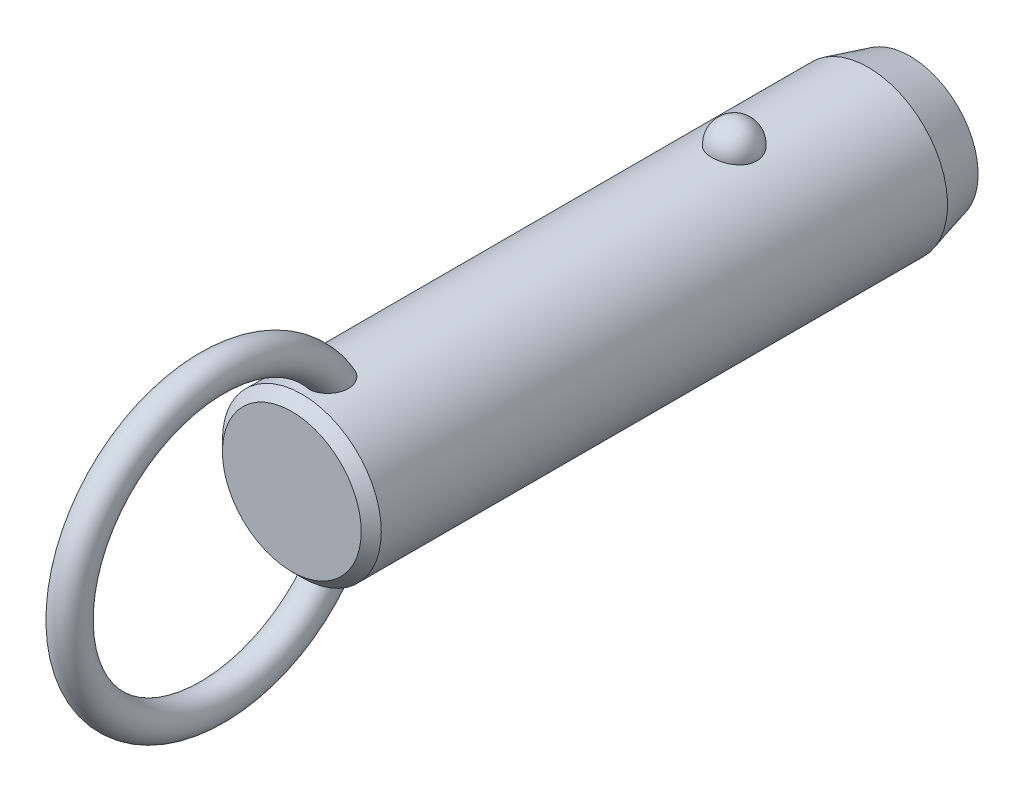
ISO-10303-21;
HEADER;
FILE_DESCRIPTION(('STEP AP214'),'2;1');
FILE_NAME('part.step','',(''),(''),'','','');
FILE_SCHEMA(('AUTOMOTIVE_DESIGN { 1 0 10303 214 1 1 1 1 }'));
ENDSEC;
DATA;
#1=APPLICATION_CONTEXT('core data for automotive mechanical design processes');
#2=APPLICATION_PROTOCOL_DEFINITION('international standard','automotive_design',2000,#1);
#3=PRODUCT_CONTEXT('',#1,'mechanical');
#4=PRODUCT('Part','Part','',(#3));
#5=PRODUCT_RELATED_PRODUCT_CATEGORY('part','',(#4));
#6=PRODUCT_DEFINITION_FORMATION('','',#4);
#7=PRODUCT_DEFINITION_CONTEXT('part definition',#1,'design');
#8=PRODUCT_DEFINITION('design','',#6,#7);
#9=PRODUCT_DEFINITION_SHAPE('','',#8);
#10=(LENGTH_UNIT() NAMED_UNIT(*) SI_UNIT(.MILLI.,.METRE.));
#11=(NAMED_UNIT(*) PLANE_ANGLE_UNIT() SI_UNIT($,.RADIAN.));
#12=(NAMED_UNIT(*) SI_UNIT($,.STERADIAN.) SOLID_ANGLE_UNIT());
#13=UNCERTAINTY_MEASURE_WITH_UNIT(LENGTH_MEASURE(1.E-05),#10,'distance_accuracy_value','');
#14=(GEOMETRIC_REPRESENTATION_CONTEXT(3) GLOBAL_UNCERTAINTY_ASSIGNED_CONTEXT((#13)) GLOBAL_UNIT_ASSIGNED_CONTEXT((#10,
#11,#12)) REPRESENTATION_CONTEXT('',''));
#15=CARTESIAN_POINT('',(0.,0.,0.));
#16=DIRECTION('',(0.,0.,1.));
#17=DIRECTION('',(1.,0.,0.));
#18=AXIS2_PLACEMENT_3D('',#15,#16,#17);
#19=CARTESIAN_POINT('',(0.,0.,40.7));
#20=DIRECTION('',(0.,0.,-1.));
#21=DIRECTION('',(-1.,0.,0.));
#22=AXIS2_PLACEMENT_3D('',#19,#20,#21);
#23=CYLINDRICAL_SURFACE('',#22,9.5);
#24=CARTESIAN_POINT('',(2.67259918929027,9.11631578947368,-2.7));
#25=CARTESIAN_POINT('',(2.6725968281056,9.11631786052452,-2.54909854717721));
#26=CARTESIAN_POINT('',(2.66030567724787,9.11994722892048,-2.39816735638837));
#27=CARTESIAN_POINT('',(2.6114347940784,9.13405924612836,-2.10058568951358));
#28=CARTESIAN_POINT('',(2.57484658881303,9.14454428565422,-1.95393672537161));
#29=CARTESIAN_POINT('',(2.47830875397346,9.17117631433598,-1.66916069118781));
#30=CARTESIAN_POINT('',(2.41836936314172,9.18732082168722,-1.53102991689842));
#31=CARTESIAN_POINT('',(2.27661331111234,9.22346780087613,-1.26705393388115));
#32=CARTESIAN_POINT('',(2.19479699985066,9.24347021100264,-1.14120852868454));
#33=CARTESIAN_POINT('',(2.01085282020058,9.28522401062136,-0.90463270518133));
#34=CARTESIAN_POINT('',(1.90862396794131,9.30698376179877,-0.793982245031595));
#35=CARTESIAN_POINT('',(1.6867437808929,9.34973971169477,-0.591607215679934));
#36=CARTESIAN_POINT('',(1.56709244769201,9.37073591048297,-0.499882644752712));
#37=CARTESIAN_POINT('',(1.31393976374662,9.40956370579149,-0.338167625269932));
#38=CARTESIAN_POINT('',(1.18048026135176,9.42740444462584,-0.268113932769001));
#39=CARTESIAN_POINT('',(0.903154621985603,9.45799906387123,-0.151390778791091));
#40=CARTESIAN_POINT('',(0.759289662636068,9.47075351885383,-0.104718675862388));
#41=CARTESIAN_POINT('',(0.468074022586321,9.48956256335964,-0.0367633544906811));
#42=CARTESIAN_POINT('',(0.320836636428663,9.49573643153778,-0.0150275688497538));
#43=CARTESIAN_POINT('',(0.0246714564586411,9.50112183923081,0.00396199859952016));
#44=CARTESIAN_POINT('',(-0.124256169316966,9.50033406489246,0.00121819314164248));
#45=CARTESIAN_POINT('',(-0.417264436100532,9.4919475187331,-0.0284441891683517));
#46=CARTESIAN_POINT('',(-0.56138413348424,9.48444885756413,-0.0550074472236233));
#47=CARTESIAN_POINT('',(-0.842986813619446,9.46357853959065,-0.131064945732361));
#48=CARTESIAN_POINT('',(-0.980469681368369,9.450206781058,-0.180559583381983));
#49=CARTESIAN_POINT('',(-1.24585005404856,9.41890822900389,-0.301476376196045));
#50=CARTESIAN_POINT('',(-1.37368611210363,9.40095498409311,-0.37302638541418));
#51=CARTESIAN_POINT('',(-1.61552738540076,9.36242964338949,-0.536025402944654));
#52=CARTESIAN_POINT('',(-1.72953116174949,9.34185727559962,-0.627476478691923));
#53=CARTESIAN_POINT('',(-1.9429225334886,9.29984568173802,-0.829844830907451));
#54=CARTESIAN_POINT('',(-2.04198021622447,9.27839736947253,-0.941108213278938));
#55=CARTESIAN_POINT('',(-2.22026460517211,9.23735994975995,-1.17883414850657));
#56=CARTESIAN_POINT('',(-2.29948985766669,9.21777097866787,-1.30529781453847));
#57=CARTESIAN_POINT('',(-2.43697287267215,9.18238994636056,-1.57158566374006));
#58=CARTESIAN_POINT('',(-2.49497068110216,9.16664569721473,-1.71155057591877));
#59=CARTESIAN_POINT('',(-2.5872073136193,9.14104303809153,-1.99961197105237));
#60=CARTESIAN_POINT('',(-2.62144683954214,9.13118445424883,-2.14770821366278));
#61=CARTESIAN_POINT('',(-2.66521466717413,9.11850622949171,-2.44715424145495));
#62=CARTESIAN_POINT('',(-2.67484831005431,9.11565658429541,-2.59848735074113));
#63=CARTESIAN_POINT('',(-2.66946735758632,9.11723375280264,-2.90067317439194));
#64=CARTESIAN_POINT('',(-2.65445345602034,9.12166036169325,-3.05152590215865));
#65=CARTESIAN_POINT('',(-2.60029711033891,9.13724422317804,-3.34766110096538));
#66=CARTESIAN_POINT('',(-2.56127978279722,9.14836656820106,-3.49296833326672));
#67=CARTESIAN_POINT('',(-2.46018844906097,9.17606676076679,-3.77477535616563));
#68=CARTESIAN_POINT('',(-2.39811349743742,9.1926448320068,-3.9112747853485));
#69=CARTESIAN_POINT('',(-2.25202303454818,9.22952198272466,-4.17244273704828));
#70=CARTESIAN_POINT('',(-2.16788714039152,9.24984129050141,-4.29704106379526));
#71=CARTESIAN_POINT('',(-1.9799408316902,9.29188255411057,-4.53013066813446));
#72=CARTESIAN_POINT('',(-1.87612963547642,9.31360456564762,-4.63862130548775));
#73=CARTESIAN_POINT('',(-1.65105429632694,9.35612959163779,-4.8369029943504));
#74=CARTESIAN_POINT('',(-1.52972405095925,9.37692871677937,-4.92661991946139));
#75=CARTESIAN_POINT('',(-1.27318250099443,9.41518970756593,-5.08429106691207));
#76=CARTESIAN_POINT('',(-1.13797219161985,9.432651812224,-5.15224684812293));
#77=CARTESIAN_POINT('',(-0.859280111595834,9.46208255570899,-5.26371827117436));
#78=CARTESIAN_POINT('',(-0.715925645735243,9.47411833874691,-5.30753421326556));
#79=CARTESIAN_POINT('',(-0.423550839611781,9.4916822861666,-5.37076321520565));
#80=CARTESIAN_POINT('',(-0.2745312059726,9.49721125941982,-5.39017930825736));
#81=CARTESIAN_POINT('',(0.0218446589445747,9.50110860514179,-5.40390587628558));
#82=CARTESIAN_POINT('',(0.16917707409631,9.49961381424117,-5.39869609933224));
#83=CARTESIAN_POINT('',(0.460808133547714,9.48993906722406,-5.36441955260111));
#84=CARTESIAN_POINT('',(0.605106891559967,9.48175936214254,-5.33535367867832));
#85=CARTESIAN_POINT('',(0.886027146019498,9.4596376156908,-5.25435587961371));
#86=CARTESIAN_POINT('',(1.02267710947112,9.44571881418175,-5.20251612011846));
#87=CARTESIAN_POINT('',(1.28523827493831,9.41358993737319,-5.07741549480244));
#88=CARTESIAN_POINT('',(1.41114877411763,9.39537958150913,-5.00415322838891));
#89=CARTESIAN_POINT('',(1.65085227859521,9.3562644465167,-4.83684599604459));
#90=CARTESIAN_POINT('',(1.76442346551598,9.33532178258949,-4.74249218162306));
#91=CARTESIAN_POINT('',(1.97425672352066,9.29321198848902,-4.53620389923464));
#92=CARTESIAN_POINT('',(2.07051582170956,9.27204482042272,-4.42426641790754));
#93=CARTESIAN_POINT('',(2.24490086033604,9.23139221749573,-4.18363183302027));
#94=CARTESIAN_POINT('',(2.32267019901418,9.21194380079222,-4.05466990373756));
#95=CARTESIAN_POINT('',(2.45584092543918,9.1773419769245,-3.78517836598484));
#96=CARTESIAN_POINT('',(2.5112497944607,9.16218713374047,-3.64465264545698));
#97=CARTESIAN_POINT('',(2.59380876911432,9.13913522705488,-3.37104301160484));
#98=CARTESIAN_POINT('',(2.62330266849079,9.13064624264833,-3.23871053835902));
#99=CARTESIAN_POINT('',(2.66269870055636,9.11923566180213,-2.97092664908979));
#100=CARTESIAN_POINT('',(2.67260130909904,9.11631393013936,-2.83547530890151));
#101=CARTESIAN_POINT('',(2.67259918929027,9.11631578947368,-2.7));
#102=B_SPLINE_CURVE_WITH_KNOTS('',3,(#24,#25,#26,#27,#28,#29,#30,#31,#32,#33,#34,#35,#36,#37,
#38,#39,#40,#41,#42,#43,#44,#45,#46,#47,#48,#49,#50,#51,#52,#53,#54,#55,#56,#57,#58,#59,#60,#61,
#62,#63,#64,#65,#66,#67,#68,#69,#70,#71,#72,#73,#74,#75,#76,#77,#78,#79,#80,#81,#82,#83,#84,#85,
#86,#87,#88,#89,#90,#91,#92,#93,#94,#95,#96,#97,#98,#99,#100,#101),.UNSPECIFIED.,.T.,.F.,(4,2,2,
2,2,2,2,2,2,2,2,2,2,2,2,2,2,2,2,2,2,2,2,2,2,2,2,2,2,2,2,2,2,2,2,2,2,2,4),(0.,0.452217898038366,
0.904593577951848,1.35677112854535,1.80894144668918,2.26340676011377,2.71787203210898,
3.17099820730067,3.62407318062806,4.0687883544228,4.51345969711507,4.95160616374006,
5.38976021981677,5.83050358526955,6.27129275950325,6.72071308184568,7.17016633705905,
7.62495278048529,8.07972578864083,8.53254856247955,8.98535859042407,9.43582813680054,
9.88631615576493,10.3393155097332,10.7923328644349,11.2471065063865,11.7018475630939,
12.150795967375,12.599688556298,13.0398725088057,13.4800399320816,13.9184421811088,
14.3568730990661,14.802202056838,15.2476074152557,15.7010097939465,16.1542603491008,
16.5602594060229,16.966248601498),.UNSPECIFIED.);
#103=CARTESIAN_POINT('',(2.67259918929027,9.11631578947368,-2.7));
#104=VERTEX_POINT('',#103);
#105=EDGE_CURVE('E41',#104,#104,#102,.T.);
#106=ORIENTED_EDGE('',*,*,#105,.T.);
#107=EDGE_LOOP('',(#106));
#108=FACE_BOUND('',#107,.T.);
#109=CARTESIAN_POINT('',(0.,0.,49.02));
#110=DIRECTION('',(0.,0.,1.));
#111=DIRECTION('',(1.,0.,0.));
#112=AXIS2_PLACEMENT_3D('',#109,#110,#111);
#113=CIRCLE('',#112,9.5);
#114=CARTESIAN_POINT('',(9.5,0.,49.02));
#115=VERTEX_POINT('',#114);
#116=EDGE_CURVE('E10',#115,#115,#113,.F.);
#117=ORIENTED_EDGE('',*,*,#116,.T.);
#118=EDGE_LOOP('',(#117));
#119=FACE_BOUND('',#118,.T.);
#120=CARTESIAN_POINT('',(-0.697062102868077,-9.47439269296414,43.3678088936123));
#121=CARTESIAN_POINT('',(-0.799579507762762,-9.46685146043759,43.4074823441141));
#122=CARTESIAN_POINT('',(-0.898575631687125,-9.45788043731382,43.4559309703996));
#123=CARTESIAN_POINT('',(-1.08670047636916,-9.43811593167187,43.5688685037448));
#124=CARTESIAN_POINT('',(-1.17583204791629,-9.42732297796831,43.633352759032));
#125=CARTESIAN_POINT('',(-1.34179806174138,-9.40513672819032,43.7762099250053));
#126=CARTESIAN_POINT('',(-1.41865133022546,-9.39374438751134,43.854561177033));
#127=CARTESIAN_POINT('',(-1.5586004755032,-9.37154196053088,44.0227524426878));
#128=CARTESIAN_POINT('',(-1.62169476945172,-9.3607319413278,44.1125937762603));
#129=CARTESIAN_POINT('',(-1.73527695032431,-9.34035749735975,44.3045001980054));
#130=CARTESIAN_POINT('',(-1.7852226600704,-9.33085270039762,44.4068910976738));
#131=CARTESIAN_POINT('',(-1.86924997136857,-9.3143834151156,44.618148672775));
#132=CARTESIAN_POINT('',(-1.90332570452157,-9.30741986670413,44.7270177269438));
#133=CARTESIAN_POINT('',(-1.95893603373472,-9.29588482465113,44.9604730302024));
#134=CARTESIAN_POINT('',(-1.97872420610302,-9.29165182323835,45.0854890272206));
#135=CARTESIAN_POINT('',(-2.00062129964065,-9.28695978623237,45.3370805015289));
#136=CARTESIAN_POINT('',(-2.00272284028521,-9.28650232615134,45.463656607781));
#137=CARTESIAN_POINT('',(-1.98958876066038,-9.28932750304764,45.7368157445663));
#138=CARTESIAN_POINT('',(-1.97143366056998,-9.2932400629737,45.8832519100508));
#139=CARTESIAN_POINT('',(-1.91479925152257,-9.30507151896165,46.1720629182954));
#140=CARTESIAN_POINT('',(-1.87629122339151,-9.31299607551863,46.314431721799));
#141=CARTESIAN_POINT('',(-1.77225683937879,-9.33340232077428,46.6151725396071));
#142=CARTESIAN_POINT('',(-1.70334898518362,-9.34641636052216,46.7723691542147));
#143=CARTESIAN_POINT('',(-1.58111062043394,-9.36759153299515,46.9975171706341));
#144=CARTESIAN_POINT('',(-1.53721459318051,-9.37492619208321,47.0707968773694));
#145=CARTESIAN_POINT('',(-1.44302631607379,-9.38988566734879,47.2130740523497));
#146=CARTESIAN_POINT('',(-1.39273721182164,-9.39751033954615,47.2820736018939));
#147=CARTESIAN_POINT('',(-1.26775962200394,-9.41530678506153,47.4369832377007));
#148=CARTESIAN_POINT('',(-1.19052326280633,-9.42548108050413,47.5208712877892));
#149=CARTESIAN_POINT('',(-1.02420241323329,-9.44499825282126,47.6760086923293));
#150=CARTESIAN_POINT('',(-0.935139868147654,-9.45434261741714,47.7472808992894));
#151=CARTESIAN_POINT('',(-0.766610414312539,-9.46930670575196,47.8586955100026));
#152=CARTESIAN_POINT('',(-0.689439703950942,-9.47529223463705,47.9022354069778));
#153=CARTESIAN_POINT('',(-0.528942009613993,-9.48560294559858,47.9763133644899));
#154=CARTESIAN_POINT('',(-0.44562029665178,-9.48992953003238,48.0068624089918));
#155=CARTESIAN_POINT('',(-0.273901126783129,-9.49644161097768,48.0525792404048));
#156=CARTESIAN_POINT('',(-0.185465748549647,-9.49860811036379,48.06761059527));
#157=CARTESIAN_POINT('',(-0.00734541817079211,-9.5004135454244,48.0801494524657));
#158=CARTESIAN_POINT('',(0.0823387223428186,-9.50005405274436,48.0776678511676));
#159=CARTESIAN_POINT('',(0.247679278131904,-9.49708301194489,48.0569959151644));
#160=CARTESIAN_POINT('',(0.323620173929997,-9.49477609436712,48.0409300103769));
#161=CARTESIAN_POINT('',(0.471981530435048,-9.48855917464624,47.9971726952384));
#162=CARTESIAN_POINT('',(0.54440029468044,-9.48464840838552,47.9694757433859));
#163=CARTESIAN_POINT('',(0.708947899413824,-9.47398336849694,47.8928026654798));
#164=CARTESIAN_POINT('',(0.799149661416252,-9.46671310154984,47.8397745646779));
#165=CARTESIAN_POINT('',(0.969783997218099,-9.4507622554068,47.7199731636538));
#166=CARTESIAN_POINT('',(1.05019415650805,-9.44207854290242,47.6531692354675));
#167=CARTESIAN_POINT('',(1.23092343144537,-9.42051459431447,47.4807596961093));
#168=CARTESIAN_POINT('',(1.32652499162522,-9.40733378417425,47.3702619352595));
#169=CARTESIAN_POINT('',(1.49893121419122,-9.38140745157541,47.1355614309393));
#170=CARTESIAN_POINT('',(1.57571616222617,-9.36866239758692,47.0113445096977));
#171=CARTESIAN_POINT('',(1.71285426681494,-9.34457644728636,46.7493891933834));
#172=CARTESIAN_POINT('',(1.77266365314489,-9.33328726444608,46.6113623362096));
#173=CARTESIAN_POINT('',(1.87239208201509,-9.31379209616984,46.3280515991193));
#174=CARTESIAN_POINT('',(1.91230158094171,-9.3055875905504,46.182764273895));
#175=CARTESIAN_POINT('',(1.9760418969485,-9.29228394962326,45.8620281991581));
#176=CARTESIAN_POINT('',(1.99587438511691,-9.28797202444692,45.6857248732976));
#177=CARTESIAN_POINT('',(2.0029570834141,-9.28645519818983,45.3324146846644));
#178=CARTESIAN_POINT('',(1.99025930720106,-9.28923895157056,45.1554093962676));
#179=CARTESIAN_POINT('',(1.93735479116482,-9.30038134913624,44.8563381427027));
#180=CARTESIAN_POINT('',(1.90576827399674,-9.30697680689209,44.7326679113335));
#181=CARTESIAN_POINT('',(1.82287484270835,-9.32356855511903,44.4923297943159));
#182=CARTESIAN_POINT('',(1.77158213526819,-9.33356239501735,44.3756569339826));
#183=CARTESIAN_POINT('',(1.64885744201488,-9.35602275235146,44.1527061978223));
#184=CARTESIAN_POINT('',(1.57730995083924,-9.36850332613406,44.0464927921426));
#185=CARTESIAN_POINT('',(1.41543264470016,-9.39431873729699,43.8495530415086));
#186=CARTESIAN_POINT('',(1.32510883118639,-9.40765330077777,43.7588217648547));
#187=CARTESIAN_POINT('',(1.13846223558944,-9.43195720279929,43.6050334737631));
#188=CARTESIAN_POINT('',(1.04369890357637,-9.44302894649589,43.5400947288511));
#189=CARTESIAN_POINT('',(0.843965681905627,-9.46296805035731,43.4280388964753));
#190=CARTESIAN_POINT('',(0.739000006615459,-9.4718363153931,43.3809144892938));
#191=CARTESIAN_POINT('',(0.528175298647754,-9.48586140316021,43.3081173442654));
#192=CARTESIAN_POINT('',(0.422686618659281,-9.49119633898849,43.2814024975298));
#193=CARTESIAN_POINT('',(0.208590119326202,-9.49831365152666,43.2460137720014));
#194=CARTESIAN_POINT('',(0.0999817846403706,-9.500095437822,43.2373428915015));
#195=CARTESIAN_POINT('',(-0.126104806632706,-9.49988861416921,43.2383501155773));
#196=CARTESIAN_POINT('',(-0.243578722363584,-9.49757821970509,43.2495942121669));
#197=CARTESIAN_POINT('',(-0.474390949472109,-9.48885165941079,43.293167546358));
#198=CARTESIAN_POINT('',(-0.587729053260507,-9.48243528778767,43.3254978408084));
#199=CARTESIAN_POINT('',(-0.697062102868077,-9.47439269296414,43.3678088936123));
#200=B_SPLINE_CURVE_WITH_KNOTS('',3,(#120,#121,#122,#123,#124,#125,#126,#127,#128,#129,#130,
#131,#132,#133,#134,#135,#136,#137,#138,#139,#140,#141,#142,#143,#144,#145,#146,#147,#148,#149,
#150,#151,#152,#153,#154,#155,#156,#157,#158,#159,#160,#161,#162,#163,#164,#165,#166,#167,#168,
#169,#170,#171,#172,#173,#174,#175,#176,#177,#178,#179,#180,#181,#182,#183,#184,#185,#186,#187,
#188,#189,#190,#191,#192,#193,#194,#195,#196,#197,#198,#199),.UNSPECIFIED.,.T.,.F.,(4,2,2,2,2,2,
2,2,2,2,2,2,2,2,2,2,2,2,2,2,2,2,2,2,2,2,2,2,2,2,2,2,2,2,2,2,2,2,2,4),(0.,0.330119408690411,
0.660143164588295,0.989655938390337,1.31920659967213,1.66074728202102,2.00241415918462,
2.38088696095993,2.75951768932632,3.20065679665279,3.6424200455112,4.15620996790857,
4.41314162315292,4.66994734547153,5.01228664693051,5.35399933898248,5.61943037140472,
5.88463652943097,6.15215502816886,6.41950709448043,6.65144391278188,6.88349136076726,
7.19641200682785,7.51003602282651,7.94779711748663,8.38601491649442,8.83699707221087,
9.28819530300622,9.81778662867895,10.3465317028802,10.7284172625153,11.1100280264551,
11.4938603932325,11.8775702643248,12.2220189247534,12.5663259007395,12.8915939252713,
13.2169159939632,13.5689650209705,13.9210316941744),.UNSPECIFIED.);
#201=CARTESIAN_POINT('',(-0.697062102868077,-9.47439269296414,43.3678088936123));
#202=VERTEX_POINT('',#201);
#203=EDGE_CURVE('E59',#202,#202,#200,.T.);
#204=ORIENTED_EDGE('',*,*,#203,.T.);
#205=EDGE_LOOP('',(#204));
#206=FACE_BOUND('',#205,.T.);
#207=CARTESIAN_POINT('',(-0.697062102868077,9.47439269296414,43.3678088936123));
#208=CARTESIAN_POINT('',(-0.597792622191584,9.48169483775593,43.3293956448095));
#209=CARTESIAN_POINT('',(-0.495106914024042,9.48766580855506,43.2991682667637));
#210=CARTESIAN_POINT('',(-0.285876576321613,9.49627648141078,43.2560327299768));
#211=CARTESIAN_POINT('',(-0.179324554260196,9.49890941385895,43.2431597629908));
#212=CARTESIAN_POINT('',(0.0344157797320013,9.50053798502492,43.2351666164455));
#213=CARTESIAN_POINT('',(0.141603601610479,9.49953613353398,43.2400341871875));
#214=CARTESIAN_POINT('',(0.353563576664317,9.49401038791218,43.2673654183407));
#215=CARTESIAN_POINT('',(0.458336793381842,9.48948807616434,43.28982117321));
#216=CARTESIAN_POINT('',(0.662493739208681,9.4774236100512,43.3516719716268));
#217=CARTESIAN_POINT('',(0.761881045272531,9.46988348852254,43.3910556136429));
#218=CARTESIAN_POINT('',(0.952608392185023,9.45260382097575,43.4856342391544));
#219=CARTESIAN_POINT('',(1.04394806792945,9.44286417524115,43.5408299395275));
#220=CARTESIAN_POINT('',(1.21712767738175,9.4221176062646,43.6660662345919));
#221=CARTESIAN_POINT('',(1.29885671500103,9.41109835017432,43.7362579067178));
#222=CARTESIAN_POINT('',(1.4497897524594,9.38903310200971,43.888980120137));
#223=CARTESIAN_POINT('',(1.51899278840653,9.37798710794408,43.9715116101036));
#224=CARTESIAN_POINT('',(1.64602857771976,9.35654375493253,44.1497763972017));
#225=CARTESIAN_POINT('',(1.70333052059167,9.34618688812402,44.2458916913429));
#226=CARTESIAN_POINT('',(1.80259341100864,9.32755128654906,44.445897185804));
#227=CARTESIAN_POINT('',(1.84454942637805,9.31927322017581,44.5497898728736));
#228=CARTESIAN_POINT('',(1.91637039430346,9.30478365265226,44.7722131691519));
#229=CARTESIAN_POINT('',(1.944805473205,9.29882552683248,44.8912192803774));
#230=CARTESIAN_POINT('',(1.98449865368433,9.29043398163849,45.1321436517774));
#231=CARTESIAN_POINT('',(1.99574908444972,9.28800213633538,45.2540631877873));
#232=CARTESIAN_POINT('',(2.00275141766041,9.28649645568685,45.5169324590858));
#233=CARTESIAN_POINT('',(1.99588238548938,9.28799035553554,45.6579529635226));
#234=CARTESIAN_POINT('',(1.96270559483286,9.29505517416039,45.9376217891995));
#235=CARTESIAN_POINT('',(1.93637872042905,9.30063010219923,46.076267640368));
#236=CARTESIAN_POINT('',(1.85949176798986,9.31633564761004,46.3725616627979));
#237=CARTESIAN_POINT('',(1.80549792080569,9.3270926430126,46.5292907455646));
#238=CARTESIAN_POINT('',(1.67376869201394,9.3516306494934,46.8322840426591));
#239=CARTESIAN_POINT('',(1.59603181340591,9.36541185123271,46.9785475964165));
#240=CARTESIAN_POINT('',(1.4360277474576,9.39110706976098,47.2258138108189));
#241=CARTESIAN_POINT('',(1.35831795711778,9.40278656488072,47.329791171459));
#242=CARTESIAN_POINT('',(1.18774483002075,9.42585025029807,47.5245347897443));
#243=CARTESIAN_POINT('',(1.09490932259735,9.43723493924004,47.6153247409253));
#244=CARTESIAN_POINT('',(0.921110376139,9.45552616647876,47.7562033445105));
#245=CARTESIAN_POINT('',(0.843738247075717,9.46281058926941,47.8106563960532));
#246=CARTESIAN_POINT('',(0.681245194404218,9.47589120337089,47.9067117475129));
#247=CARTESIAN_POINT('',(0.596135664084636,9.48168953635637,47.9483325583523));
#248=CARTESIAN_POINT('',(0.433779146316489,9.49038144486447,48.0100899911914));
#249=CARTESIAN_POINT('',(0.357459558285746,9.49359170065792,48.0326013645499));
#250=CARTESIAN_POINT('',(0.20207411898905,9.49816761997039,48.0645745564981));
#251=CARTESIAN_POINT('',(0.12301025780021,9.49953459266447,48.0740456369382));
#252=CARTESIAN_POINT('',(-0.0357372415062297,9.50026497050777,48.0791143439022));
#253=CARTESIAN_POINT('',(-0.115421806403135,9.49962433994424,48.0746840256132));
#254=CARTESIAN_POINT('',(-0.272823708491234,9.49640854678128,48.0522962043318));
#255=CARTESIAN_POINT('',(-0.350540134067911,9.4938325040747,48.0343325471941));
#256=CARTESIAN_POINT('',(-0.500580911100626,9.4870946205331,47.9868028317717));
#257=CARTESIAN_POINT('',(-0.572979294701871,9.48296359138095,47.9574618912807));
#258=CARTESIAN_POINT('',(-0.712864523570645,9.47347609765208,47.8890087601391));
#259=CARTESIAN_POINT('',(-0.7803490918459,9.46811906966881,47.8498920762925));
#260=CARTESIAN_POINT('',(-0.946309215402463,9.45329720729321,47.739432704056));
#261=CARTESIAN_POINT('',(-1.04090230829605,9.44321512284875,47.6623297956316));
#262=CARTESIAN_POINT('',(-1.21661929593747,9.42219227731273,47.4940971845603));
#263=CARTESIAN_POINT('',(-1.29770519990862,9.41124921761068,47.4029292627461));
#264=CARTESIAN_POINT('',(-1.4731964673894,9.38563439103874,47.1761621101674));
#265=CARTESIAN_POINT('',(-1.56208878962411,9.37102009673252,47.0362895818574));
#266=CARTESIAN_POINT('',(-1.71623987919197,9.34401559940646,46.7439503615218));
#267=CARTESIAN_POINT('',(-1.7814786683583,9.33162728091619,46.5914731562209));
#268=CARTESIAN_POINT('',(-1.88853837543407,9.31055541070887,46.2756470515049));
#269=CARTESIAN_POINT('',(-1.9299899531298,9.30193076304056,46.1121685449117));
#270=CARTESIAN_POINT('',(-1.98590726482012,9.29015757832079,45.7805268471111));
#271=CARTESIAN_POINT('',(-2.00040705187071,9.2870021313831,45.6123698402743));
#272=CARTESIAN_POINT('',(-1.99964701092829,9.28716218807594,45.3050806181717));
#273=CARTESIAN_POINT('',(-1.98908145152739,9.28945704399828,45.1659362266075));
#274=CARTESIAN_POINT('',(-1.94566294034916,9.29865169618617,44.8911539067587));
#275=CARTESIAN_POINT('',(-1.91282062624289,9.30554929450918,44.755514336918));
#276=CARTESIAN_POINT('',(-1.84582133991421,9.31898248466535,44.5578026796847));
#277=CARTESIAN_POINT('',(-1.82038084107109,9.32400364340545,44.4925830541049));
#278=CARTESIAN_POINT('',(-1.76350511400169,9.33492884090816,44.3649033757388));
#279=CARTESIAN_POINT('',(-1.73207305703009,9.3408324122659,44.3024418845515));
#280=CARTESIAN_POINT('',(-1.66324243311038,9.353333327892,44.1809407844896));
#281=CARTESIAN_POINT('',(-1.62584239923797,9.35993084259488,44.1219020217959));
#282=CARTESIAN_POINT('',(-1.545276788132,9.37356864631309,44.0079875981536));
#283=CARTESIAN_POINT('',(-1.50211241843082,9.38060884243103,43.9531110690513));
#284=CARTESIAN_POINT('',(-1.37681147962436,9.40004442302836,43.8099619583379));
#285=CARTESIAN_POINT('',(-1.28916358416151,9.41261047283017,43.7264295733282));
#286=CARTESIAN_POINT('',(-1.09996826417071,9.43658180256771,43.5772360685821));
#287=CARTESIAN_POINT('',(-0.998461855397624,9.44799034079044,43.5115238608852));
#288=CARTESIAN_POINT('',(-0.860188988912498,9.46103017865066,43.4394367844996));
#289=CARTESIAN_POINT('',(-0.82814120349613,9.46389141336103,43.4238511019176));
#290=CARTESIAN_POINT('',(-0.763210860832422,9.46934915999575,43.3944734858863));
#291=CARTESIAN_POINT('',(-0.730328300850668,9.47194567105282,43.3806815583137));
#292=CARTESIAN_POINT('',(-0.697062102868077,9.47439269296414,43.3678088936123));
#293=B_SPLINE_CURVE_WITH_KNOTS('',3,(#207,#208,#209,#210,#211,#212,#213,#214,#215,#216,#217,
#218,#219,#220,#221,#222,#223,#224,#225,#226,#227,#228,#229,#230,#231,#232,#233,#234,#235,#236,
#237,#238,#239,#240,#241,#242,#243,#244,#245,#246,#247,#248,#249,#250,#251,#252,#253,#254,#255,
#256,#257,#258,#259,#260,#261,#262,#263,#264,#265,#266,#267,#268,#269,#270,#271,#272,#273,#274,
#275,#276,#277,#278,#279,#280,#281,#282,#283,#284,#285,#286,#287,#288,#289,#290,#291,#292),
.UNSPECIFIED.,.T.,.F.,(4,2,2,2,2,2,2,2,2,2,2,2,2,2,2,2,2,2,2,2,2,2,2,2,2,2,2,2,2,2,2,2,2,2,2,2,
2,2,2,2,2,2,4),(0.,0.319942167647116,0.640532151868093,0.96090081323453,1.28112555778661,
1.60113495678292,1.92115886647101,2.24457323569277,2.56801248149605,2.90371927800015,
3.23953387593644,3.60560313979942,3.97183576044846,4.39383693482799,4.81625324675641,
5.31257045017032,5.80891895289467,6.19868344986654,6.58773876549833,6.87145417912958,
7.15475838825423,7.3926375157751,7.63034760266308,7.86853584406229,8.10683246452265,
8.3406366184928,8.57454843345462,8.93983939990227,9.30614105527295,9.80266668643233,
10.2996107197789,10.8040753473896,11.3079021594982,11.7249776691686,12.1418541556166,
12.3521485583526,12.562331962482,12.7725671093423,12.9827582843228,13.3458276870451,
13.7078449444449,13.8150604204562,13.9222762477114),.UNSPECIFIED.);
#294=CARTESIAN_POINT('',(-0.697062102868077,9.47439269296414,43.3678088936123));
#295=VERTEX_POINT('',#294);
#296=EDGE_CURVE('E67',#295,#295,#293,.T.);
#297=ORIENTED_EDGE('',*,*,#296,.T.);
#298=EDGE_LOOP('',(#297));
#299=FACE_BOUND('',#298,.T.);
#300=CARTESIAN_POINT('',(0.,0.,-18.6999999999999));
#301=DIRECTION('',(0.,0.,-1.));
#302=DIRECTION('',(-1.,0.,0.));
#303=AXIS2_PLACEMENT_3D('',#300,#301,#302);
#304=CIRCLE('',#303,9.5);
#305=CARTESIAN_POINT('',(-9.5,0.,-18.6999999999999));
#306=VERTEX_POINT('',#305);
#307=EDGE_CURVE('E56',#306,#306,#304,.F.);
#308=ORIENTED_EDGE('',*,*,#307,.T.);
#309=EDGE_LOOP('',(#308));
#310=FACE_BOUND('',#309,.T.);
#311=ADVANCED_FACE('F37',(#108,#119,#206,#299,#310),#23,.T.);
#312=CARTESIAN_POINT('',(0.,0.,-23.7));
#313=DIRECTION('',(0.,0.,-1.));
#314=DIRECTION('',(-1.,0.,0.));
#315=AXIS2_PLACEMENT_3D('',#312,#313,#314);
#316=PLANE('',#315);
#317=CARTESIAN_POINT('',(0.,0.,-23.7));
#318=DIRECTION('',(0.,0.,-1.));
#319=DIRECTION('',(-1.,0.,0.));
#320=AXIS2_PLACEMENT_3D('',#317,#318,#319);
#321=CIRCLE('',#320,8.16025403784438);
#322=CARTESIAN_POINT('',(-8.16025403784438,0.,-23.7));
#323=VERTEX_POINT('',#322);
#324=EDGE_CURVE('E66',#323,#323,#321,.T.);
#325=ORIENTED_EDGE('',*,*,#324,.T.);
#326=EDGE_LOOP('',(#325));
#327=FACE_BOUND('',#326,.T.);
#328=ADVANCED_FACE('F85',(#327),#316,.T.);
#329=CARTESIAN_POINT('',(0.,0.,-23.7));
#330=DIRECTION('',(0.,0.,1.));
#331=DIRECTION('',(1.,0.,0.));
#332=AXIS2_PLACEMENT_3D('',#329,#330,#331);
#333=CONICAL_SURFACE('',#332,8.16025403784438,0.261799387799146);
#334=ORIENTED_EDGE('',*,*,#307,.F.);
#335=EDGE_LOOP('',(#334));
#336=FACE_BOUND('',#335,.T.);
#337=ORIENTED_EDGE('',*,*,#324,.F.);
#338=EDGE_LOOP('',(#337));
#339=FACE_BOUND('',#338,.T.);
#340=ADVANCED_FACE('F83',(#336,#339),#333,.T.);
#341=CARTESIAN_POINT('',(0.,0.,50.22));
#342=DIRECTION('',(0.,0.,1.));
#343=DIRECTION('',(1.,0.,0.));
#344=AXIS2_PLACEMENT_3D('',#341,#342,#343);
#345=PLANE('',#344);
#346=CARTESIAN_POINT('',(0.,0.,50.22));
#347=DIRECTION('',(0.,0.,1.));
#348=DIRECTION('',(1.,0.,0.));
#349=AXIS2_PLACEMENT_3D('',#346,#347,#348);
#350=CIRCLE('',#349,8.30000000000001);
#351=CARTESIAN_POINT('',(8.30000000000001,0.,50.22));
#352=VERTEX_POINT('',#351);
#353=EDGE_CURVE('E50',#352,#352,#350,.T.);
#354=ORIENTED_EDGE('',*,*,#353,.T.);
#355=EDGE_LOOP('',(#354));
#356=FACE_BOUND('',#355,.T.);
#357=ADVANCED_FACE('F77',(#356),#345,.T.);
#358=CARTESIAN_POINT('',(0.,0.,59.75));
#359=DIRECTION('',(1.,0.,0.));
#360=DIRECTION('',(0.,0.,-1.));
#361=AXIS2_PLACEMENT_3D('',#358,#359,#360);
#362=TOROIDAL_SURFACE('',#361,17.05,2.);
#363=ORIENTED_EDGE('',*,*,#296,.F.);
#364=EDGE_LOOP('',(#363));
#365=FACE_BOUND('',#364,.T.);
#366=ORIENTED_EDGE('',*,*,#203,.F.);
#367=EDGE_LOOP('',(#366));
#368=FACE_BOUND('',#367,.T.);
#369=ADVANCED_FACE('F73',(#365,#368),#362,.T.);
#370=CARTESIAN_POINT('',(0.,0.,50.22));
#371=DIRECTION('',(0.,0.,-1.));
#372=DIRECTION('',(-1.,0.,0.));
#373=AXIS2_PLACEMENT_3D('',#370,#371,#372);
#374=CONICAL_SURFACE('',#373,8.30000000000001,0.78539816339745);
#375=ORIENTED_EDGE('',*,*,#116,.F.);
#376=EDGE_LOOP('',(#375));
#377=FACE_BOUND('',#376,.T.);
#378=ORIENTED_EDGE('',*,*,#353,.F.);
#379=EDGE_LOOP('',(#378));
#380=FACE_BOUND('',#379,.T.);
#381=ADVANCED_FACE('F39',(#377,#380),#374,.T.);
#382=CARTESIAN_POINT('',(0.,9.5,-2.7));
#383=DIRECTION('',(0.,1.,0.));
#384=DIRECTION('',(0.,0.,-1.));
#385=AXIS2_PLACEMENT_3D('',#382,#383,#384);
#386=SPHERICAL_SURFACE('',#385,2.7);
#387=ORIENTED_EDGE('',*,*,#105,.F.);
#388=EDGE_LOOP('',(#387));
#389=FACE_BOUND('',#388,.T.);
#390=ADVANCED_FACE('F79',(#389),#386,.T.);
#391=CLOSED_SHELL('',(#311,#328,#340,#357,#369,#381,#390));
#392=MANIFOLD_SOLID_BREP('B2',#391);
#393=ADVANCED_BREP_SHAPE_REPRESENTATION('',(#18,#392),#14);
#394=SHAPE_DEFINITION_REPRESENTATION(#9,#393);
ENDSEC;
END-ISO-10303-21;
